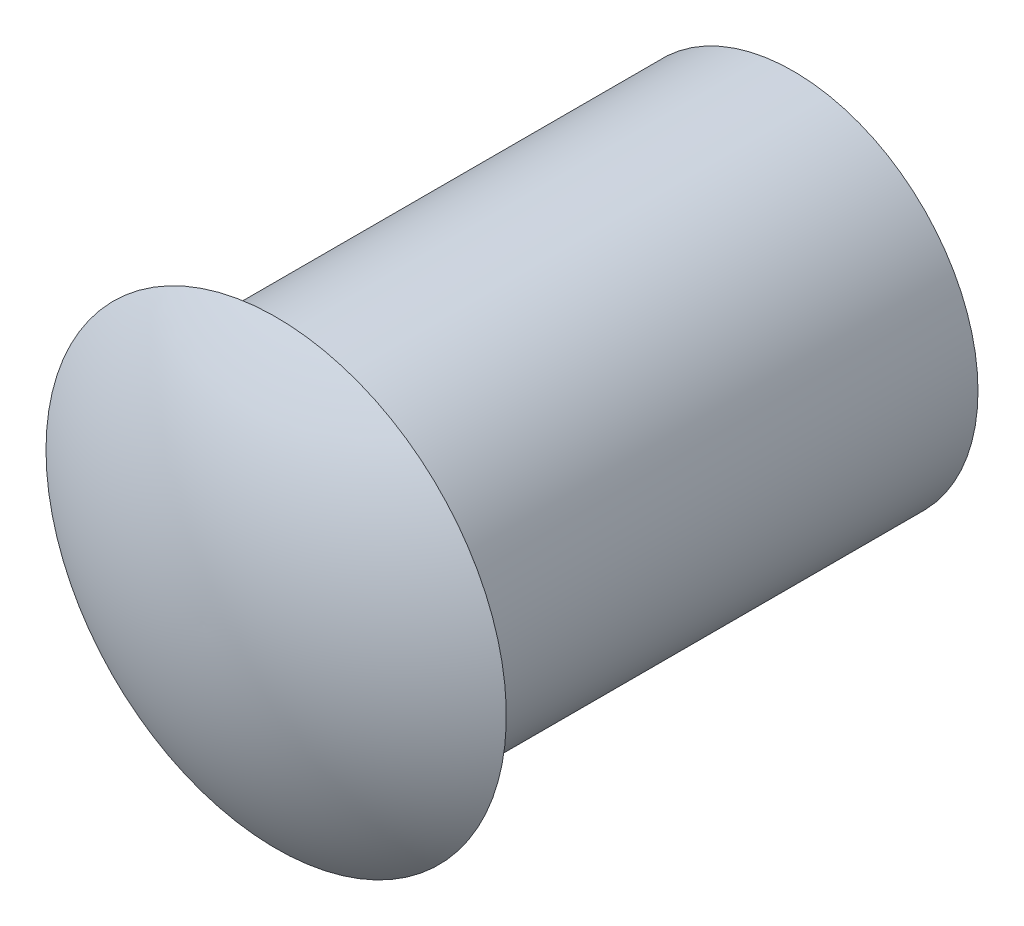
ISO-10303-21;
HEADER;
FILE_DESCRIPTION(('STEP AP214'),'2;1');
FILE_NAME('part.step','',(''),(''),'','','');
FILE_SCHEMA(('AUTOMOTIVE_DESIGN { 1 0 10303 214 1 1 1 1 }'));
ENDSEC;
DATA;
#1=APPLICATION_CONTEXT('core data for automotive mechanical design processes');
#2=APPLICATION_PROTOCOL_DEFINITION('international standard','automotive_design',2000,#1);
#3=PRODUCT_CONTEXT('',#1,'mechanical');
#4=PRODUCT('Part','Part','',(#3));
#5=PRODUCT_RELATED_PRODUCT_CATEGORY('part','',(#4));
#6=PRODUCT_DEFINITION_FORMATION('','',#4);
#7=PRODUCT_DEFINITION_CONTEXT('part definition',#1,'design');
#8=PRODUCT_DEFINITION('design','',#6,#7);
#9=PRODUCT_DEFINITION_SHAPE('','',#8);
#10=(LENGTH_UNIT() NAMED_UNIT(*) SI_UNIT(.MILLI.,.METRE.));
#11=(NAMED_UNIT(*) PLANE_ANGLE_UNIT() SI_UNIT($,.RADIAN.));
#12=(NAMED_UNIT(*) SI_UNIT($,.STERADIAN.) SOLID_ANGLE_UNIT());
#13=UNCERTAINTY_MEASURE_WITH_UNIT(LENGTH_MEASURE(1.E-05),#10,'distance_accuracy_value','');
#14=(GEOMETRIC_REPRESENTATION_CONTEXT(3) GLOBAL_UNCERTAINTY_ASSIGNED_CONTEXT((#13)) GLOBAL_UNIT_ASSIGNED_CONTEXT((#10,
#11,#12)) REPRESENTATION_CONTEXT('',''));
#15=CARTESIAN_POINT('',(0.,0.,0.));
#16=DIRECTION('',(0.,0.,1.));
#17=DIRECTION('',(1.,0.,0.));
#18=AXIS2_PLACEMENT_3D('',#15,#16,#17);
#19=CARTESIAN_POINT('',(0.,0.,-8.382));
#20=DIRECTION('',(0.,0.,1.));
#21=DIRECTION('',(1.,0.,0.));
#22=AXIS2_PLACEMENT_3D('',#19,#20,#21);
#23=CYLINDRICAL_SURFACE('',#22,2.99251043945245);
#24=CARTESIAN_POINT('',(0.,0.,-8.382));
#25=DIRECTION('',(0.,0.,1.));
#26=DIRECTION('',(1.,0.,0.));
#27=AXIS2_PLACEMENT_3D('',#24,#25,#26);
#28=CIRCLE('',#27,2.99251043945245);
#29=CARTESIAN_POINT('',(2.99251043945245,0.,-8.382));
#30=VERTEX_POINT('',#29);
#31=EDGE_CURVE('E11',#30,#30,#28,.T.);
#32=ORIENTED_EDGE('',*,*,#31,.T.);
#33=EDGE_LOOP('',(#32));
#34=FACE_BOUND('',#33,.T.);
#35=CARTESIAN_POINT('',(0.,0.,0.));
#36=DIRECTION('',(0.,0.,1.));
#37=DIRECTION('',(1.,0.,0.));
#38=AXIS2_PLACEMENT_3D('',#35,#36,#37);
#39=CIRCLE('',#38,2.99251043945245);
#40=CARTESIAN_POINT('',(2.99251043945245,0.,0.));
#41=VERTEX_POINT('',#40);
#42=EDGE_CURVE('E36',#41,#41,#39,.T.);
#43=ORIENTED_EDGE('',*,*,#42,.F.);
#44=EDGE_LOOP('',(#43));
#45=FACE_BOUND('',#44,.T.);
#46=ADVANCED_FACE('F33',(#34,#45),#23,.T.);
#47=CARTESIAN_POINT('',(0.,0.,-8.382));
#48=DIRECTION('',(0.,0.,1.));
#49=DIRECTION('',(1.,0.,0.));
#50=AXIS2_PLACEMENT_3D('',#47,#48,#49);
#51=PLANE('',#50);
#52=ORIENTED_EDGE('',*,*,#31,.F.);
#53=EDGE_LOOP('',(#52));
#54=FACE_BOUND('',#53,.T.);
#55=ADVANCED_FACE('F46',(#54),#51,.F.);
#56=CARTESIAN_POINT('',(-0.045212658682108,0.,-5.15900585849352));
#57=DIRECTION('',(0.,-1.,0.));
#58=DIRECTION('',(-1.,0.,0.));
#59=AXIS2_PLACEMENT_3D('',#56,#57,#58);
#60=CIRCLE('',#59,6.33998070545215);
#61=TRIMMED_CURVE('',#60,(PARAMETER_VALUE(-1.57792774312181)),
(PARAMETER_VALUE(1.57792774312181)),.T.,.PARAMETER.);
#62=CARTESIAN_POINT('',(0.,0.,-5.15900585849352));
#63=DIRECTION('',(0.,0.,-1.));
#64=AXIS1_PLACEMENT('',#62,#63);
#65=SURFACE_OF_REVOLUTION('',#61,#64);
#66=CARTESIAN_POINT('',(0.,0.,1.18081363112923));
#67=VERTEX_POINT('',#66);
#68=VERTEX_LOOP('',#67);
#69=FACE_BOUND('',#68,.T.);
#70=CARTESIAN_POINT('',(0.,0.,0.));
#71=DIRECTION('',(0.,0.,-1.));
#72=DIRECTION('',(-1.,0.,0.));
#73=AXIS2_PLACEMENT_3D('',#70,#71,#72);
#74=CIRCLE('',#73,3.73031969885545);
#75=CARTESIAN_POINT('',(-3.73031969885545,0.,0.));
#76=VERTEX_POINT('',#75);
#77=EDGE_CURVE('E50',#76,#76,#74,.T.);
#78=ORIENTED_EDGE('',*,*,#77,.F.);
#79=EDGE_LOOP('',(#78));
#80=FACE_BOUND('',#79,.T.);
#81=ADVANCED_FACE('F42',(#69,#80),#65,.T.);
#82=CARTESIAN_POINT('',(-3.73031969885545,0.,0.));
#83=DIRECTION('',(0.,0.,-1.));
#84=DIRECTION('',(-1.,0.,0.));
#85=AXIS2_PLACEMENT_3D('',#82,#83,#84);
#86=PLANE('',#85);
#87=ORIENTED_EDGE('',*,*,#42,.T.);
#88=EDGE_LOOP('',(#87));
#89=FACE_BOUND('',#88,.T.);
#90=ORIENTED_EDGE('',*,*,#77,.T.);
#91=EDGE_LOOP('',(#90));
#92=FACE_BOUND('',#91,.T.);
#93=ADVANCED_FACE('F45',(#89,#92),#86,.T.);
#94=CLOSED_SHELL('',(#46,#55,#81,#93));
#95=MANIFOLD_SOLID_BREP('B2',#94);
#96=ADVANCED_BREP_SHAPE_REPRESENTATION('',(#18,#95),#14);
#97=SHAPE_DEFINITION_REPRESENTATION(#9,#96);
ENDSEC;
END-ISO-10303-21;
